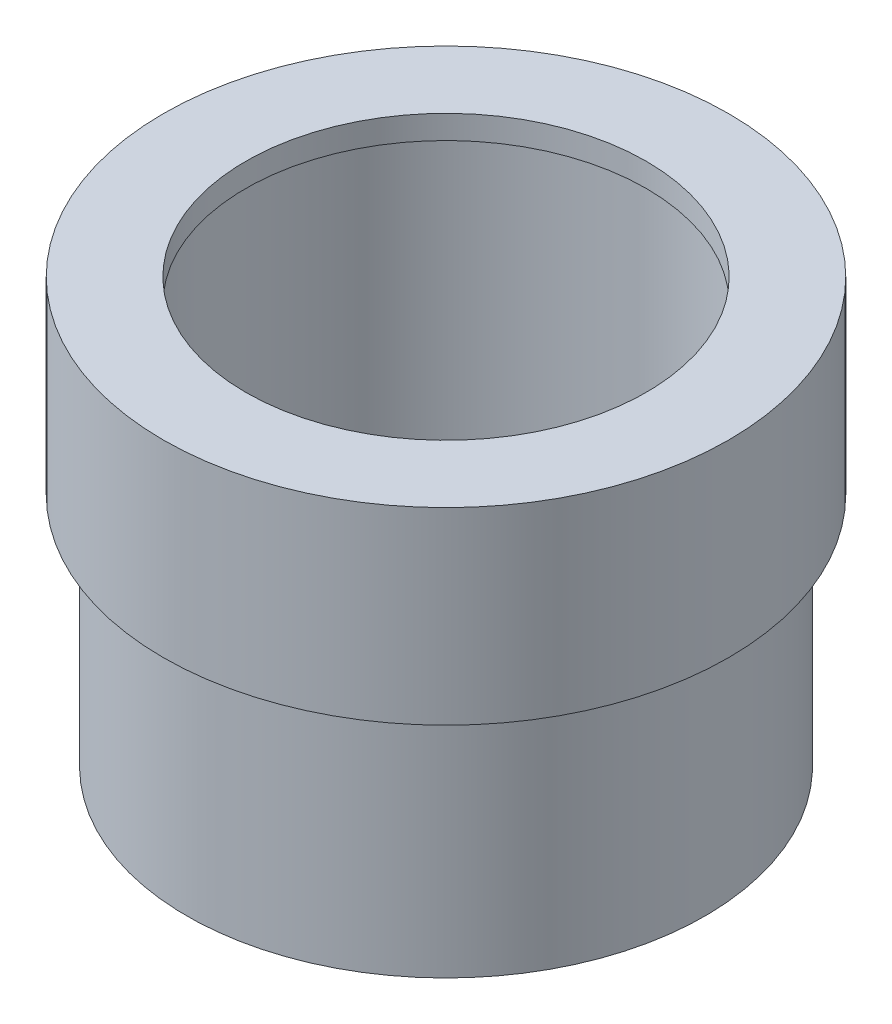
from build123d import *


with BuildPart() as part:
    # Sketch1 → Revolve1 (revolve)
    with BuildSketch(Plane.XY, mode=Mode.PRIVATE) as revolve1_sk:
        Polygon((14.2875, 0), (14.2875, 26.9875), (13.49375, 26.9875), (13.49375, 28.575), (19.05, 28.575), (19.05, 15.875), (17.4625, 15.875), (17.4625, 0), align=None)
    revolve(revolve1_sk.sketch.rotate(Axis((0, 0, 0), (0, 1, 0)), 90), axis=Axis((0, 0, 0), (0, 1, 0)))


solid = part.part
